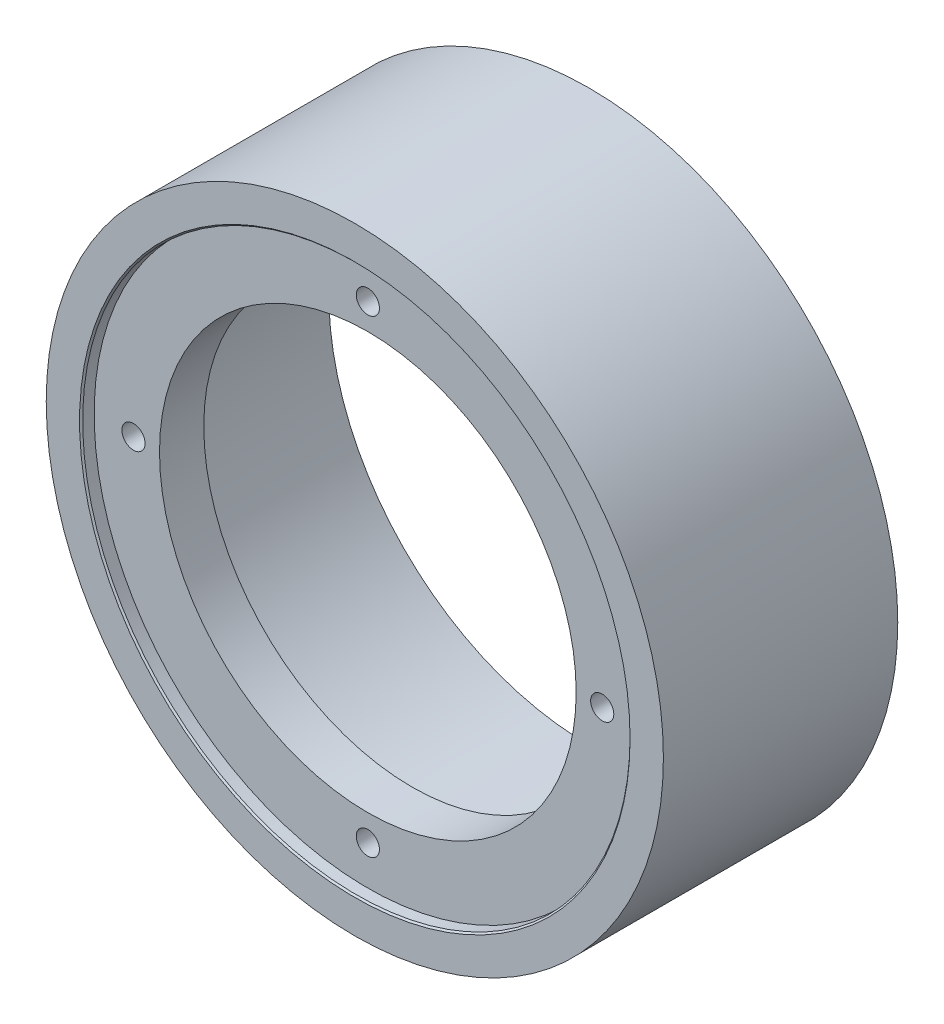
from build123d import *

# Parameters (mm, degrees)
SKETCH1_R             = 30.099
SKETCH1_R_2           = 25.4
EXTRUDE1_DEPTH        = 22.86
EXTRUDE2_START        = -5.588
SKETCH2_R             = 30.099
SKETCH2_R_2           = 20.32
EXTRUDE2_DEPTH        = 5.588
SKETCH3_R             = 26.6954
CUT_EXTRUDE1_DEPTH    = 1.27
F_4_40_TAPPED_HOLE3_D = 2.2606
CIRPATTERN1_COUNT     = 4
CHAMFER1_SIZE         = 0.1524


with BuildPart() as part:
    # Sketch1 → Extrude1 (new body)
    with BuildSketch(Plane.XY):
        Circle(SKETCH1_R)
        Circle(SKETCH1_R_2, mode=Mode.SUBTRACT)
    extrude(amount=EXTRUDE1_DEPTH)

    # Sketch2 → Extrude2 (add)
    with BuildSketch(Plane.XY.offset(22.86).offset(EXTRUDE2_START)):
        Circle(SKETCH2_R)
        Circle(SKETCH2_R_2, mode=Mode.SUBTRACT)
    extrude(amount=EXTRUDE2_DEPTH)

    # Sketch3 → Cut-Extrude1 (cut)
    with BuildSketch(Plane.XY.offset(22.86)):
        Circle(SKETCH3_R)
    extrude(amount=-CUT_EXTRUDE1_DEPTH, mode=Mode.SUBTRACT)

    # 4-40 Tapped Hole3 (through all)
    with Locations(Plane.XY.offset(21.59)):
        with Locations((0, 22.86)):
            f_4_40_tapped_hole3 = Hole(F_4_40_TAPPED_HOLE3_D / 2)

    # CirPattern1: 4-40 Tapped Hole3 ×4 about axis
    cirpattern1_axis = Axis((0, 0, 0), (0, 0, 1))
    for i in range(1, CIRPATTERN1_COUNT):
        add(f_4_40_tapped_hole3.rotate(cirpattern1_axis, i * 360 / CIRPATTERN1_COUNT), mode=Mode.SUBTRACT)

    # Chamfer1
    chamfer1_edges = [part.edges().sort_by_distance(p)[0] for p in [
        (-26.6954, 0, 22.86),
    ]]
    chamfer(chamfer1_edges, length=CHAMFER1_SIZE)


solid = part.part
